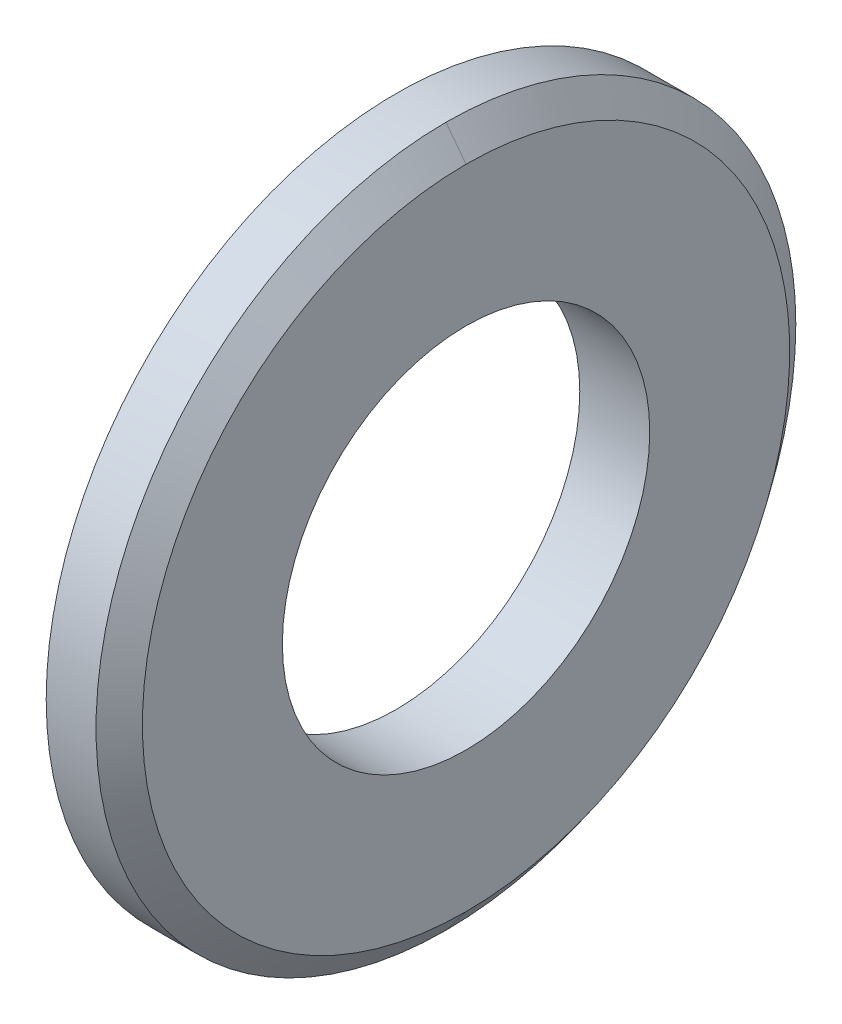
ISO-10303-21;
HEADER;
FILE_DESCRIPTION(('STEP AP214'),'2;1');
FILE_NAME('part.step','',(''),(''),'','','');
FILE_SCHEMA(('AUTOMOTIVE_DESIGN { 1 0 10303 214 1 1 1 1 }'));
ENDSEC;
DATA;
#1=APPLICATION_CONTEXT('core data for automotive mechanical design processes');
#2=APPLICATION_PROTOCOL_DEFINITION('international standard','automotive_design',2000,#1);
#3=PRODUCT_CONTEXT('',#1,'mechanical');
#4=PRODUCT('Part','Part','',(#3));
#5=PRODUCT_RELATED_PRODUCT_CATEGORY('part','',(#4));
#6=PRODUCT_DEFINITION_FORMATION('','',#4);
#7=PRODUCT_DEFINITION_CONTEXT('part definition',#1,'design');
#8=PRODUCT_DEFINITION('design','',#6,#7);
#9=PRODUCT_DEFINITION_SHAPE('','',#8);
#10=(LENGTH_UNIT() NAMED_UNIT(*) SI_UNIT(.MILLI.,.METRE.));
#11=(NAMED_UNIT(*) PLANE_ANGLE_UNIT() SI_UNIT($,.RADIAN.));
#12=(NAMED_UNIT(*) SI_UNIT($,.STERADIAN.) SOLID_ANGLE_UNIT());
#13=UNCERTAINTY_MEASURE_WITH_UNIT(LENGTH_MEASURE(1.E-05),#10,'distance_accuracy_value','');
#14=(GEOMETRIC_REPRESENTATION_CONTEXT(3) GLOBAL_UNCERTAINTY_ASSIGNED_CONTEXT((#13)) GLOBAL_UNIT_ASSIGNED_CONTEXT((#10,
#11,#12)) REPRESENTATION_CONTEXT('',''));
#15=CARTESIAN_POINT('',(0.,0.,0.));
#16=DIRECTION('',(0.,0.,1.));
#17=DIRECTION('',(1.,0.,0.));
#18=AXIS2_PLACEMENT_3D('',#15,#16,#17);
#19=CARTESIAN_POINT('',(1.13960380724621,0.,0.));
#20=DIRECTION('',(-1.,0.,0.));
#21=DIRECTION('',(0.,-1.,0.));
#22=AXIS2_PLACEMENT_3D('',#19,#20,#21);
#23=CONICAL_SURFACE('',#22,7.99999999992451,0.916297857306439);
#24=DIRECTION('',(0.608761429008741,0.79335334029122,-1.41658906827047E-12));
#25=VECTOR('',#24,1.);
#26=CARTESIAN_POINT('',(-406342.585761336,-529565.452990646,9.45561850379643E-07));
#27=LINE('',#26,#25);
#28=CARTESIAN_POINT('',(1.59999999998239,-7.40000000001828,-1.8862093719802E-12));
#29=VERTEX_POINT('',#28);
#30=CARTESIAN_POINT('',(1.13960380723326,-7.99999999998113,-3.04656454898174E-13));
#31=VERTEX_POINT('',#30);
#32=EDGE_CURVE('E41',#29,#31,#27,.F.);
#33=ORIENTED_EDGE('',*,*,#32,.F.);
#34=CARTESIAN_POINT('',(1.59999999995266,0.,0.));
#35=DIRECTION('',(-1.,0.,0.));
#36=DIRECTION('',(0.,-1.,0.));
#37=AXIS2_PLACEMENT_3D('',#34,#35,#36);
#38=CIRCLE('',#37,7.40000000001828);
#39=CARTESIAN_POINT('',(1.5999999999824,7.39999999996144,1.80833561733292E-11));
#40=VERTEX_POINT('',#39);
#41=EDGE_CURVE('E54',#40,#29,#38,.F.);
#42=ORIENTED_EDGE('',*,*,#41,.F.);
#43=DIRECTION('',(0.608761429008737,-0.793353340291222,2.41140440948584E-12));
#44=VECTOR('',#43,1.);
#45=CARTESIAN_POINT('',(-406342.585761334,529565.452990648,-1.60957824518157E-06));
#46=LINE('',#45,#44);
#47=CARTESIAN_POINT('',(1.13960380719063,8.00000000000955,4.06463813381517E-12));
#48=VERTEX_POINT('',#47);
#49=EDGE_CURVE('E47',#48,#40,#46,.T.);
#50=ORIENTED_EDGE('',*,*,#49,.F.);
#51=CARTESIAN_POINT('',(1.13960380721,0.,0.));
#52=DIRECTION('',(1.,0.,0.));
#53=DIRECTION('',(0.,0.,-1.));
#54=AXIS2_PLACEMENT_3D('',#51,#52,#53);
#55=CIRCLE('',#54,8.);
#56=EDGE_CURVE('E33',#31,#48,#55,.F.);
#57=ORIENTED_EDGE('',*,*,#56,.F.);
#58=EDGE_LOOP('',(#33,#42,#50,#57));
#59=FACE_BOUND('',#58,.T.);
#60=ADVANCED_FACE('F16',(#59),#23,.T.);
#61=CARTESIAN_POINT('',(1.13960380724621,0.,0.));
#62=DIRECTION('',(-1.,0.,0.));
#63=DIRECTION('',(0.,0.,1.));
#64=AXIS2_PLACEMENT_3D('',#61,#62,#63);
#65=CONICAL_SURFACE('',#64,7.99999999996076,0.916297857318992);
#66=ORIENTED_EDGE('',*,*,#49,.T.);
#67=CARTESIAN_POINT('',(1.60000000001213,0.,0.));
#68=DIRECTION('',(-1.,0.,0.));
#69=DIRECTION('',(0.,0.,1.));
#70=AXIS2_PLACEMENT_3D('',#67,#68,#69);
#71=CIRCLE('',#70,7.39999999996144);
#72=EDGE_CURVE('E19',#29,#40,#71,.F.);
#73=ORIENTED_EDGE('',*,*,#72,.F.);
#74=ORIENTED_EDGE('',*,*,#32,.T.);
#75=CARTESIAN_POINT('',(1.13960380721,0.,0.));
#76=DIRECTION('',(1.,0.,0.));
#77=DIRECTION('',(0.,0.,-1.));
#78=AXIS2_PLACEMENT_3D('',#75,#76,#77);
#79=CIRCLE('',#78,8.);
#80=EDGE_CURVE('E50',#48,#31,#79,.F.);
#81=ORIENTED_EDGE('',*,*,#80,.F.);
#82=EDGE_LOOP('',(#66,#73,#74,#81));
#83=FACE_BOUND('',#82,.T.);
#84=ADVANCED_FACE('F49',(#83),#65,.T.);
#85=CARTESIAN_POINT('',(1.6,0.,0.));
#86=DIRECTION('',(1.,0.,0.));
#87=DIRECTION('',(0.,0.,-1.));
#88=AXIS2_PLACEMENT_3D('',#85,#86,#87);
#89=PLANE('',#88);
#90=CARTESIAN_POINT('',(1.6,0.,0.));
#91=DIRECTION('',(1.,0.,0.));
#92=DIRECTION('',(0.,0.,-1.));
#93=AXIS2_PLACEMENT_3D('',#90,#91,#92);
#94=CIRCLE('',#93,4.2);
#95=CARTESIAN_POINT('',(1.6,0.,-4.2));
#96=VERTEX_POINT('',#95);
#97=EDGE_CURVE('E57',#96,#96,#94,.F.);
#98=ORIENTED_EDGE('',*,*,#97,.T.);
#99=EDGE_LOOP('',(#98));
#100=FACE_BOUND('',#99,.T.);
#101=ORIENTED_EDGE('',*,*,#72,.T.);
#102=ORIENTED_EDGE('',*,*,#41,.T.);
#103=EDGE_LOOP('',(#101,#102));
#104=FACE_BOUND('',#103,.T.);
#105=ADVANCED_FACE('F53',(#100,#104),#89,.T.);
#106=CARTESIAN_POINT('',(0.8,0.,0.));
#107=DIRECTION('',(1.,0.,0.));
#108=DIRECTION('',(0.,0.,-1.));
#109=AXIS2_PLACEMENT_3D('',#106,#107,#108);
#110=CYLINDRICAL_SURFACE('',#109,8.);
#111=CARTESIAN_POINT('',(0.,0.,0.));
#112=DIRECTION('',(1.,0.,0.));
#113=DIRECTION('',(0.,0.,-1.));
#114=AXIS2_PLACEMENT_3D('',#111,#112,#113);
#115=CIRCLE('',#114,8.);
#116=CARTESIAN_POINT('',(0.,0.,-8.));
#117=VERTEX_POINT('',#116);
#118=EDGE_CURVE('E25',#117,#117,#115,.T.);
#119=ORIENTED_EDGE('',*,*,#118,.T.);
#120=EDGE_LOOP('',(#119));
#121=FACE_BOUND('',#120,.T.);
#122=ORIENTED_EDGE('',*,*,#80,.T.);
#123=ORIENTED_EDGE('',*,*,#56,.T.);
#124=EDGE_LOOP('',(#122,#123));
#125=FACE_BOUND('',#124,.T.);
#126=ADVANCED_FACE('F71',(#121,#125),#110,.T.);
#127=CARTESIAN_POINT('',(0.8,0.,0.));
#128=DIRECTION('',(1.,0.,0.));
#129=DIRECTION('',(0.,0.,-1.));
#130=AXIS2_PLACEMENT_3D('',#127,#128,#129);
#131=CYLINDRICAL_SURFACE('',#130,4.2);
#132=CARTESIAN_POINT('',(0.,0.,0.));
#133=DIRECTION('',(1.,0.,0.));
#134=DIRECTION('',(0.,0.,-1.));
#135=AXIS2_PLACEMENT_3D('',#132,#133,#134);
#136=CIRCLE('',#135,4.2);
#137=CARTESIAN_POINT('',(0.,0.,-4.2));
#138=VERTEX_POINT('',#137);
#139=EDGE_CURVE('E11',#138,#138,#136,.F.);
#140=ORIENTED_EDGE('',*,*,#139,.T.);
#141=EDGE_LOOP('',(#140));
#142=FACE_BOUND('',#141,.T.);
#143=ORIENTED_EDGE('',*,*,#97,.F.);
#144=EDGE_LOOP('',(#143));
#145=FACE_BOUND('',#144,.T.);
#146=ADVANCED_FACE('F73',(#142,#145),#131,.F.);
#147=CARTESIAN_POINT('',(0.,0.,0.));
#148=DIRECTION('',(1.,0.,0.));
#149=DIRECTION('',(0.,0.,-1.));
#150=AXIS2_PLACEMENT_3D('',#147,#148,#149);
#151=PLANE('',#150);
#152=ORIENTED_EDGE('',*,*,#139,.F.);
#153=EDGE_LOOP('',(#152));
#154=FACE_BOUND('',#153,.T.);
#155=ORIENTED_EDGE('',*,*,#118,.F.);
#156=EDGE_LOOP('',(#155));
#157=FACE_BOUND('',#156,.T.);
#158=ADVANCED_FACE('F81',(#154,#157),#151,.F.);
#159=CLOSED_SHELL('',(#60,#84,#105,#126,#146,#158));
#160=MANIFOLD_SOLID_BREP('B1',#159);
#161=ADVANCED_BREP_SHAPE_REPRESENTATION('',(#18,#160),#14);
#162=SHAPE_DEFINITION_REPRESENTATION(#9,#161);
ENDSEC;
END-ISO-10303-21;
